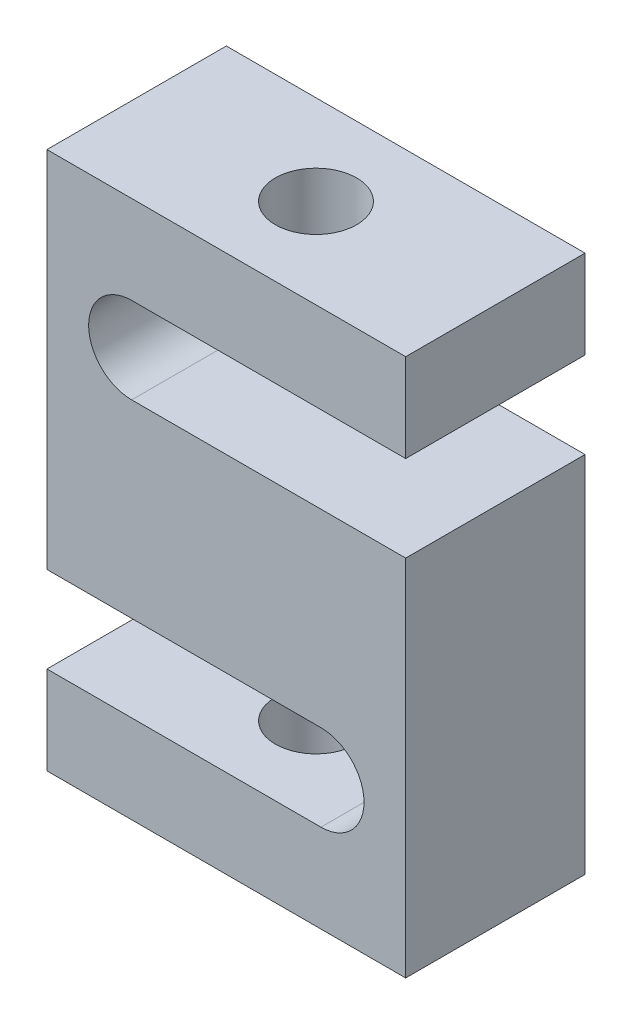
ISO-10303-21;
HEADER;
FILE_DESCRIPTION(('STEP AP214'),'2;1');
FILE_NAME('part.step','',(''),(''),'','','');
FILE_SCHEMA(('AUTOMOTIVE_DESIGN { 1 0 10303 214 1 1 1 1 }'));
ENDSEC;
DATA;
#1=APPLICATION_CONTEXT('core data for automotive mechanical design processes');
#2=APPLICATION_PROTOCOL_DEFINITION('international standard','automotive_design',2000,#1);
#3=PRODUCT_CONTEXT('',#1,'mechanical');
#4=PRODUCT('Part','Part','',(#3));
#5=PRODUCT_RELATED_PRODUCT_CATEGORY('part','',(#4));
#6=PRODUCT_DEFINITION_FORMATION('','',#4);
#7=PRODUCT_DEFINITION_CONTEXT('part definition',#1,'design');
#8=PRODUCT_DEFINITION('design','',#6,#7);
#9=PRODUCT_DEFINITION_SHAPE('','',#8);
#10=(LENGTH_UNIT() NAMED_UNIT(*) SI_UNIT(.MILLI.,.METRE.));
#11=(NAMED_UNIT(*) PLANE_ANGLE_UNIT() SI_UNIT($,.RADIAN.));
#12=(NAMED_UNIT(*) SI_UNIT($,.STERADIAN.) SOLID_ANGLE_UNIT());
#13=UNCERTAINTY_MEASURE_WITH_UNIT(LENGTH_MEASURE(1.E-05),#10,'distance_accuracy_value','');
#14=(GEOMETRIC_REPRESENTATION_CONTEXT(3) GLOBAL_UNCERTAINTY_ASSIGNED_CONTEXT((#13)) GLOBAL_UNIT_ASSIGNED_CONTEXT((#10,
#11,#12)) REPRESENTATION_CONTEXT('',''));
#15=CARTESIAN_POINT('',(0.,0.,0.));
#16=DIRECTION('',(0.,0.,1.));
#17=DIRECTION('',(1.,0.,0.));
#18=AXIS2_PLACEMENT_3D('',#15,#16,#17);
#19=CARTESIAN_POINT('',(25.4,13.4,12.7));
#20=DIRECTION('',(-1.,0.,0.));
#21=DIRECTION('',(0.,-1.,0.));
#22=AXIS2_PLACEMENT_3D('',#19,#20,#21);
#23=PLANE('',#22);
#24=DIRECTION('',(0.,1.,0.));
#25=VECTOR('',#24,1.);
#26=CARTESIAN_POINT('',(25.4,13.4,-12.7));
#27=LINE('',#26,#25);
#28=CARTESIAN_POINT('',(25.4,-38.1,-12.7));
#29=VERTEX_POINT('',#28);
#30=CARTESIAN_POINT('',(25.4,13.4,-12.7));
#31=VERTEX_POINT('',#30);
#32=EDGE_CURVE('E155',#29,#31,#27,.T.);
#33=ORIENTED_EDGE('',*,*,#32,.T.);
#34=DIRECTION('',(0.,0.,-1.));
#35=VECTOR('',#34,1.);
#36=CARTESIAN_POINT('',(25.4,13.4,12.7));
#37=LINE('',#36,#35);
#38=CARTESIAN_POINT('',(25.4,13.4,12.7));
#39=VERTEX_POINT('',#38);
#40=EDGE_CURVE('E11',#39,#31,#37,.T.);
#41=ORIENTED_EDGE('',*,*,#40,.F.);
#42=DIRECTION('',(0.,1.,0.));
#43=VECTOR('',#42,1.);
#44=CARTESIAN_POINT('',(25.4,13.4,12.7));
#45=LINE('',#44,#43);
#46=CARTESIAN_POINT('',(25.4,-38.1,12.7));
#47=VERTEX_POINT('',#46);
#48=EDGE_CURVE('E178',#47,#39,#45,.T.);
#49=ORIENTED_EDGE('',*,*,#48,.F.);
#50=DIRECTION('',(0.,0.,-1.));
#51=VECTOR('',#50,1.);
#52=CARTESIAN_POINT('',(25.4,-38.1,12.7));
#53=LINE('',#52,#51);
#54=EDGE_CURVE('E151',#47,#29,#53,.T.);
#55=ORIENTED_EDGE('',*,*,#54,.T.);
#56=EDGE_LOOP('',(#33,#41,#49,#55));
#57=FACE_BOUND('',#56,.T.);
#58=ADVANCED_FACE('F35',(#57),#23,.F.);
#59=CARTESIAN_POINT('',(25.4,13.4,12.7));
#60=DIRECTION('',(0.,-1.,0.));
#61=DIRECTION('',(1.,0.,0.));
#62=AXIS2_PLACEMENT_3D('',#59,#60,#61);
#63=PLANE('',#62);
#64=DIRECTION('',(-1.,0.,0.));
#65=VECTOR('',#64,1.);
#66=CARTESIAN_POINT('',(25.4,13.4,-12.7));
#67=LINE('',#66,#65);
#68=CARTESIAN_POINT('',(-13.4,13.4,-12.7));
#69=VERTEX_POINT('',#68);
#70=EDGE_CURVE('E158',#31,#69,#67,.T.);
#71=ORIENTED_EDGE('',*,*,#70,.T.);
#72=DIRECTION('',(0.,0.,-1.));
#73=VECTOR('',#72,1.);
#74=CARTESIAN_POINT('',(-13.4,13.4,12.7));
#75=LINE('',#74,#73);
#76=CARTESIAN_POINT('',(-13.4,13.4,12.7));
#77=VERTEX_POINT('',#76);
#78=EDGE_CURVE('E43',#77,#69,#75,.T.);
#79=ORIENTED_EDGE('',*,*,#78,.F.);
#80=DIRECTION('',(-1.,0.,0.));
#81=VECTOR('',#80,1.);
#82=CARTESIAN_POINT('',(25.4,13.4,12.7));
#83=LINE('',#82,#81);
#84=EDGE_CURVE('E106',#39,#77,#83,.T.);
#85=ORIENTED_EDGE('',*,*,#84,.F.);
#86=ORIENTED_EDGE('',*,*,#40,.T.);
#87=EDGE_LOOP('',(#71,#79,#85,#86));
#88=FACE_BOUND('',#87,.T.);
#89=ADVANCED_FACE('F258',(#88),#63,.F.);
#90=CARTESIAN_POINT('',(-13.4,19.5,12.7));
#91=DIRECTION('',(0.,0.,-1.));
#92=DIRECTION('',(-1.,0.,0.));
#93=AXIS2_PLACEMENT_3D('',#90,#91,#92);
#94=CYLINDRICAL_SURFACE('',#93,6.09999999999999);
#95=CARTESIAN_POINT('',(-13.4,19.5,-12.7));
#96=DIRECTION('',(0.,0.,-1.));
#97=DIRECTION('',(1.,0.,0.));
#98=AXIS2_PLACEMENT_3D('',#95,#96,#97);
#99=CIRCLE('',#98,6.09999999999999);
#100=CARTESIAN_POINT('',(-13.4,25.6,-12.7));
#101=VERTEX_POINT('',#100);
#102=EDGE_CURVE('E161',#69,#101,#99,.T.);
#103=ORIENTED_EDGE('',*,*,#102,.T.);
#104=DIRECTION('',(0.,0.,-1.));
#105=VECTOR('',#104,1.);
#106=CARTESIAN_POINT('',(-13.4,25.6,12.7));
#107=LINE('',#106,#105);
#108=CARTESIAN_POINT('',(-13.4,25.6,12.7));
#109=VERTEX_POINT('',#108);
#110=EDGE_CURVE('E197',#109,#101,#107,.T.);
#111=ORIENTED_EDGE('',*,*,#110,.F.);
#112=CARTESIAN_POINT('',(-13.4,19.5,12.7));
#113=DIRECTION('',(0.,0.,-1.));
#114=DIRECTION('',(1.,0.,0.));
#115=AXIS2_PLACEMENT_3D('',#112,#113,#114);
#116=CIRCLE('',#115,6.09999999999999);
#117=EDGE_CURVE('E205',#77,#109,#116,.T.);
#118=ORIENTED_EDGE('',*,*,#117,.F.);
#119=ORIENTED_EDGE('',*,*,#78,.T.);
#120=EDGE_LOOP('',(#103,#111,#118,#119));
#121=FACE_BOUND('',#120,.T.);
#122=ADVANCED_FACE('F203',(#121),#94,.F.);
#123=CARTESIAN_POINT('',(25.4,25.6,12.7));
#124=DIRECTION('',(0.,1.,0.));
#125=DIRECTION('',(-1.,0.,0.));
#126=AXIS2_PLACEMENT_3D('',#123,#124,#125);
#127=PLANE('',#126);
#128=CARTESIAN_POINT('',(0.,25.6,0.));
#129=DIRECTION('',(0.,1.,0.));
#130=DIRECTION('',(-1.,0.,0.));
#131=AXIS2_PLACEMENT_3D('',#128,#129,#130);
#132=CIRCLE('',#131,5.75436999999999);
#133=CARTESIAN_POINT('',(-5.75436999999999,25.6,0.));
#134=VERTEX_POINT('',#133);
#135=EDGE_CURVE('E159',#134,#134,#132,.T.);
#136=ORIENTED_EDGE('',*,*,#135,.T.);
#137=EDGE_LOOP('',(#136));
#138=FACE_BOUND('',#137,.T.);
#139=DIRECTION('',(1.,0.,0.));
#140=VECTOR('',#139,1.);
#141=CARTESIAN_POINT('',(25.4,25.6,-12.7));
#142=LINE('',#141,#140);
#143=CARTESIAN_POINT('',(25.4,25.6,-12.7));
#144=VERTEX_POINT('',#143);
#145=EDGE_CURVE('E163',#101,#144,#142,.T.);
#146=ORIENTED_EDGE('',*,*,#145,.T.);
#147=DIRECTION('',(0.,0.,-1.));
#148=VECTOR('',#147,1.);
#149=CARTESIAN_POINT('',(25.4,25.6,12.7));
#150=LINE('',#149,#148);
#151=CARTESIAN_POINT('',(25.4,25.6,12.7));
#152=VERTEX_POINT('',#151);
#153=EDGE_CURVE('E194',#152,#144,#150,.T.);
#154=ORIENTED_EDGE('',*,*,#153,.F.);
#155=DIRECTION('',(1.,0.,0.));
#156=VECTOR('',#155,1.);
#157=CARTESIAN_POINT('',(25.4,25.6,12.7));
#158=LINE('',#157,#156);
#159=EDGE_CURVE('E223',#109,#152,#158,.T.);
#160=ORIENTED_EDGE('',*,*,#159,.F.);
#161=ORIENTED_EDGE('',*,*,#110,.T.);
#162=EDGE_LOOP('',(#146,#154,#160,#161));
#163=FACE_BOUND('',#162,.T.);
#164=ADVANCED_FACE('F214',(#138,#163),#127,.F.);
#165=CARTESIAN_POINT('',(25.4,38.1,12.7));
#166=DIRECTION('',(-1.,0.,0.));
#167=DIRECTION('',(0.,-1.,0.));
#168=AXIS2_PLACEMENT_3D('',#165,#166,#167);
#169=PLANE('',#168);
#170=DIRECTION('',(0.,1.,0.));
#171=VECTOR('',#170,1.);
#172=CARTESIAN_POINT('',(25.4,38.1,-12.7));
#173=LINE('',#172,#171);
#174=CARTESIAN_POINT('',(25.4,38.1,-12.7));
#175=VERTEX_POINT('',#174);
#176=EDGE_CURVE('E165',#144,#175,#173,.T.);
#177=ORIENTED_EDGE('',*,*,#176,.T.);
#178=DIRECTION('',(0.,0.,-1.));
#179=VECTOR('',#178,1.);
#180=CARTESIAN_POINT('',(25.4,38.1,12.7));
#181=LINE('',#180,#179);
#182=CARTESIAN_POINT('',(25.4,38.1,12.7));
#183=VERTEX_POINT('',#182);
#184=EDGE_CURVE('E191',#183,#175,#181,.T.);
#185=ORIENTED_EDGE('',*,*,#184,.F.);
#186=DIRECTION('',(0.,1.,0.));
#187=VECTOR('',#186,1.);
#188=CARTESIAN_POINT('',(25.4,38.1,12.7));
#189=LINE('',#188,#187);
#190=EDGE_CURVE('E220',#152,#183,#189,.T.);
#191=ORIENTED_EDGE('',*,*,#190,.F.);
#192=ORIENTED_EDGE('',*,*,#153,.T.);
#193=EDGE_LOOP('',(#177,#185,#191,#192));
#194=FACE_BOUND('',#193,.T.);
#195=ADVANCED_FACE('F218',(#194),#169,.F.);
#196=CARTESIAN_POINT('',(-25.4,38.1,12.7));
#197=DIRECTION('',(0.,-1.,0.));
#198=DIRECTION('',(0.,0.,-1.));
#199=AXIS2_PLACEMENT_3D('',#196,#197,#198);
#200=PLANE('',#199);
#201=CARTESIAN_POINT('',(0.,38.1,0.));
#202=DIRECTION('',(0.,1.,0.));
#203=DIRECTION('',(0.,0.,1.));
#204=AXIS2_PLACEMENT_3D('',#201,#202,#203);
#205=CIRCLE('',#204,5.75436999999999);
#206=CARTESIAN_POINT('',(0.,38.1,5.75436999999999));
#207=VERTEX_POINT('',#206);
#208=EDGE_CURVE('E292',#207,#207,#205,.T.);
#209=ORIENTED_EDGE('',*,*,#208,.F.);
#210=EDGE_LOOP('',(#209));
#211=FACE_BOUND('',#210,.T.);
#212=DIRECTION('',(-1.,0.,0.));
#213=VECTOR('',#212,1.);
#214=CARTESIAN_POINT('',(-25.4,38.1,-12.7));
#215=LINE('',#214,#213);
#216=CARTESIAN_POINT('',(-25.4,38.1,-12.7));
#217=VERTEX_POINT('',#216);
#218=EDGE_CURVE('E167',#175,#217,#215,.T.);
#219=ORIENTED_EDGE('',*,*,#218,.T.);
#220=DIRECTION('',(0.,0.,-1.));
#221=VECTOR('',#220,1.);
#222=CARTESIAN_POINT('',(-25.4,38.1,12.7));
#223=LINE('',#222,#221);
#224=CARTESIAN_POINT('',(-25.4,38.1,12.7));
#225=VERTEX_POINT('',#224);
#226=EDGE_CURVE('E188',#225,#217,#223,.T.);
#227=ORIENTED_EDGE('',*,*,#226,.F.);
#228=DIRECTION('',(-1.,0.,0.));
#229=VECTOR('',#228,1.);
#230=CARTESIAN_POINT('',(-25.4,38.1,12.7));
#231=LINE('',#230,#229);
#232=EDGE_CURVE('E222',#183,#225,#231,.T.);
#233=ORIENTED_EDGE('',*,*,#232,.F.);
#234=ORIENTED_EDGE('',*,*,#184,.T.);
#235=EDGE_LOOP('',(#219,#227,#233,#234));
#236=FACE_BOUND('',#235,.T.);
#237=ADVANCED_FACE('F272',(#211,#236),#200,.F.);
#238=CARTESIAN_POINT('',(-25.4,38.1,12.7));
#239=DIRECTION('',(1.,0.,0.));
#240=DIRECTION('',(0.,1.,0.));
#241=AXIS2_PLACEMENT_3D('',#238,#239,#240);
#242=PLANE('',#241);
#243=DIRECTION('',(0.,-1.,0.));
#244=VECTOR('',#243,1.);
#245=CARTESIAN_POINT('',(-25.4,38.1,-12.7));
#246=LINE('',#245,#244);
#247=CARTESIAN_POINT('',(-25.4,-13.4,-12.7));
#248=VERTEX_POINT('',#247);
#249=EDGE_CURVE('E169',#217,#248,#246,.T.);
#250=ORIENTED_EDGE('',*,*,#249,.T.);
#251=DIRECTION('',(0.,0.,-1.));
#252=VECTOR('',#251,1.);
#253=CARTESIAN_POINT('',(-25.4,-13.4,12.7));
#254=LINE('',#253,#252);
#255=CARTESIAN_POINT('',(-25.4,-13.4,12.7));
#256=VERTEX_POINT('',#255);
#257=EDGE_CURVE('E185',#256,#248,#254,.T.);
#258=ORIENTED_EDGE('',*,*,#257,.F.);
#259=DIRECTION('',(0.,-1.,0.));
#260=VECTOR('',#259,1.);
#261=CARTESIAN_POINT('',(-25.4,38.1,12.7));
#262=LINE('',#261,#260);
#263=EDGE_CURVE('E225',#225,#256,#262,.T.);
#264=ORIENTED_EDGE('',*,*,#263,.F.);
#265=ORIENTED_EDGE('',*,*,#226,.T.);
#266=EDGE_LOOP('',(#250,#258,#264,#265));
#267=FACE_BOUND('',#266,.T.);
#268=ADVANCED_FACE('F275',(#267),#242,.F.);
#269=CARTESIAN_POINT('',(-25.4,-13.4,12.7));
#270=DIRECTION('',(0.,1.,0.));
#271=DIRECTION('',(0.,0.,1.));
#272=AXIS2_PLACEMENT_3D('',#269,#270,#271);
#273=PLANE('',#272);
#274=DIRECTION('',(1.,0.,0.));
#275=VECTOR('',#274,1.);
#276=CARTESIAN_POINT('',(-25.4,-13.4,-12.7));
#277=LINE('',#276,#275);
#278=CARTESIAN_POINT('',(13.4,-13.4,-12.7));
#279=VERTEX_POINT('',#278);
#280=EDGE_CURVE('E171',#248,#279,#277,.T.);
#281=ORIENTED_EDGE('',*,*,#280,.T.);
#282=DIRECTION('',(0.,0.,-1.));
#283=VECTOR('',#282,1.);
#284=CARTESIAN_POINT('',(13.4,-13.4,12.7));
#285=LINE('',#284,#283);
#286=CARTESIAN_POINT('',(13.4,-13.4,12.7));
#287=VERTEX_POINT('',#286);
#288=EDGE_CURVE('E182',#287,#279,#285,.T.);
#289=ORIENTED_EDGE('',*,*,#288,.F.);
#290=DIRECTION('',(1.,0.,0.));
#291=VECTOR('',#290,1.);
#292=CARTESIAN_POINT('',(-25.4,-13.4,12.7));
#293=LINE('',#292,#291);
#294=EDGE_CURVE('E231',#256,#287,#293,.T.);
#295=ORIENTED_EDGE('',*,*,#294,.F.);
#296=ORIENTED_EDGE('',*,*,#257,.T.);
#297=EDGE_LOOP('',(#281,#289,#295,#296));
#298=FACE_BOUND('',#297,.T.);
#299=ADVANCED_FACE('F237',(#298),#273,.F.);
#300=CARTESIAN_POINT('',(13.4,-19.5,12.7));
#301=DIRECTION('',(0.,0.,-1.));
#302=DIRECTION('',(-1.,0.,0.));
#303=AXIS2_PLACEMENT_3D('',#300,#301,#302);
#304=CYLINDRICAL_SURFACE('',#303,6.09999999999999);
#305=CARTESIAN_POINT('',(13.4,-19.5,-12.7));
#306=DIRECTION('',(0.,0.,-1.));
#307=DIRECTION('',(1.,0.,0.));
#308=AXIS2_PLACEMENT_3D('',#305,#306,#307);
#309=CIRCLE('',#308,6.09999999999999);
#310=CARTESIAN_POINT('',(13.4,-25.6,-12.7));
#311=VERTEX_POINT('',#310);
#312=EDGE_CURVE('E173',#279,#311,#309,.T.);
#313=ORIENTED_EDGE('',*,*,#312,.T.);
#314=DIRECTION('',(0.,0.,-1.));
#315=VECTOR('',#314,1.);
#316=CARTESIAN_POINT('',(13.4,-25.6,12.7));
#317=LINE('',#316,#315);
#318=CARTESIAN_POINT('',(13.4,-25.6,12.7));
#319=VERTEX_POINT('',#318);
#320=EDGE_CURVE('E146',#319,#311,#317,.T.);
#321=ORIENTED_EDGE('',*,*,#320,.F.);
#322=CARTESIAN_POINT('',(13.4,-19.5,12.7));
#323=DIRECTION('',(0.,0.,-1.));
#324=DIRECTION('',(1.,0.,0.));
#325=AXIS2_PLACEMENT_3D('',#322,#323,#324);
#326=CIRCLE('',#325,6.09999999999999);
#327=EDGE_CURVE('E137',#287,#319,#326,.T.);
#328=ORIENTED_EDGE('',*,*,#327,.F.);
#329=ORIENTED_EDGE('',*,*,#288,.T.);
#330=EDGE_LOOP('',(#313,#321,#328,#329));
#331=FACE_BOUND('',#330,.T.);
#332=ADVANCED_FACE('F241',(#331),#304,.F.);
#333=CARTESIAN_POINT('',(13.4,-25.6,12.7));
#334=DIRECTION('',(0.,-1.,0.));
#335=DIRECTION('',(1.,0.,0.));
#336=AXIS2_PLACEMENT_3D('',#333,#334,#335);
#337=PLANE('',#336);
#338=CARTESIAN_POINT('',(0.,-25.6,0.));
#339=DIRECTION('',(0.,-1.,0.));
#340=DIRECTION('',(1.,0.,0.));
#341=AXIS2_PLACEMENT_3D('',#338,#339,#340);
#342=CIRCLE('',#341,5.75436999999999);
#343=CARTESIAN_POINT('',(5.75436999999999,-25.6,0.));
#344=VERTEX_POINT('',#343);
#345=EDGE_CURVE('E290',#344,#344,#342,.T.);
#346=ORIENTED_EDGE('',*,*,#345,.T.);
#347=EDGE_LOOP('',(#346));
#348=FACE_BOUND('',#347,.T.);
#349=DIRECTION('',(-1.,0.,0.));
#350=VECTOR('',#349,1.);
#351=CARTESIAN_POINT('',(13.4,-25.6,-12.7));
#352=LINE('',#351,#350);
#353=CARTESIAN_POINT('',(-25.4,-25.6,-12.7));
#354=VERTEX_POINT('',#353);
#355=EDGE_CURVE('E145',#311,#354,#352,.T.);
#356=ORIENTED_EDGE('',*,*,#355,.T.);
#357=DIRECTION('',(0.,0.,-1.));
#358=VECTOR('',#357,1.);
#359=CARTESIAN_POINT('',(-25.4,-25.6,12.7));
#360=LINE('',#359,#358);
#361=CARTESIAN_POINT('',(-25.4,-25.6,12.7));
#362=VERTEX_POINT('',#361);
#363=EDGE_CURVE('E142',#362,#354,#360,.T.);
#364=ORIENTED_EDGE('',*,*,#363,.F.);
#365=DIRECTION('',(-1.,0.,0.));
#366=VECTOR('',#365,1.);
#367=CARTESIAN_POINT('',(13.4,-25.6,12.7));
#368=LINE('',#367,#366);
#369=EDGE_CURVE('E131',#319,#362,#368,.T.);
#370=ORIENTED_EDGE('',*,*,#369,.F.);
#371=ORIENTED_EDGE('',*,*,#320,.T.);
#372=EDGE_LOOP('',(#356,#364,#370,#371));
#373=FACE_BOUND('',#372,.T.);
#374=ADVANCED_FACE('F143',(#348,#373),#337,.F.);
#375=CARTESIAN_POINT('',(-25.4,-25.6,12.7));
#376=DIRECTION('',(1.,0.,0.));
#377=DIRECTION('',(0.,1.,0.));
#378=AXIS2_PLACEMENT_3D('',#375,#376,#377);
#379=PLANE('',#378);
#380=DIRECTION('',(0.,-1.,0.));
#381=VECTOR('',#380,1.);
#382=CARTESIAN_POINT('',(-25.4,-25.6,-12.7));
#383=LINE('',#382,#381);
#384=CARTESIAN_POINT('',(-25.4,-38.1,-12.7));
#385=VERTEX_POINT('',#384);
#386=EDGE_CURVE('E92',#354,#385,#383,.T.);
#387=ORIENTED_EDGE('',*,*,#386,.T.);
#388=DIRECTION('',(0.,0.,-1.));
#389=VECTOR('',#388,1.);
#390=CARTESIAN_POINT('',(-25.4,-38.1,12.7));
#391=LINE('',#390,#389);
#392=CARTESIAN_POINT('',(-25.4,-38.1,12.7));
#393=VERTEX_POINT('',#392);
#394=EDGE_CURVE('E147',#393,#385,#391,.T.);
#395=ORIENTED_EDGE('',*,*,#394,.F.);
#396=DIRECTION('',(0.,-1.,0.));
#397=VECTOR('',#396,1.);
#398=CARTESIAN_POINT('',(-25.4,-25.6,12.7));
#399=LINE('',#398,#397);
#400=EDGE_CURVE('E135',#362,#393,#399,.T.);
#401=ORIENTED_EDGE('',*,*,#400,.F.);
#402=ORIENTED_EDGE('',*,*,#363,.T.);
#403=EDGE_LOOP('',(#387,#395,#401,#402));
#404=FACE_BOUND('',#403,.T.);
#405=ADVANCED_FACE('F149',(#404),#379,.F.);
#406=CARTESIAN_POINT('',(-25.4,-38.1,12.7));
#407=DIRECTION('',(0.,1.,0.));
#408=DIRECTION('',(-1.,0.,0.));
#409=AXIS2_PLACEMENT_3D('',#406,#407,#408);
#410=PLANE('',#409);
#411=CARTESIAN_POINT('',(0.,-38.1,0.));
#412=DIRECTION('',(0.,-1.,0.));
#413=DIRECTION('',(0.,0.,-1.));
#414=AXIS2_PLACEMENT_3D('',#411,#412,#413);
#415=CIRCLE('',#414,5.75436999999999);
#416=CARTESIAN_POINT('',(0.,-38.1,-5.75436999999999));
#417=VERTEX_POINT('',#416);
#418=EDGE_CURVE('E293',#417,#417,#415,.T.);
#419=ORIENTED_EDGE('',*,*,#418,.F.);
#420=EDGE_LOOP('',(#419));
#421=FACE_BOUND('',#420,.T.);
#422=DIRECTION('',(1.,0.,0.));
#423=VECTOR('',#422,1.);
#424=CARTESIAN_POINT('',(-25.4,-38.1,-12.7));
#425=LINE('',#424,#423);
#426=EDGE_CURVE('E98',#385,#29,#425,.T.);
#427=ORIENTED_EDGE('',*,*,#426,.T.);
#428=ORIENTED_EDGE('',*,*,#54,.F.);
#429=DIRECTION('',(1.,0.,0.));
#430=VECTOR('',#429,1.);
#431=CARTESIAN_POINT('',(-25.4,-38.1,12.7));
#432=LINE('',#431,#430);
#433=EDGE_CURVE('E51',#393,#47,#432,.T.);
#434=ORIENTED_EDGE('',*,*,#433,.F.);
#435=ORIENTED_EDGE('',*,*,#394,.T.);
#436=EDGE_LOOP('',(#427,#428,#434,#435));
#437=FACE_BOUND('',#436,.T.);
#438=ADVANCED_FACE('F245',(#421,#437),#410,.F.);
#439=CARTESIAN_POINT('',(13.4,-19.5,12.7));
#440=DIRECTION('',(0.,0.,1.));
#441=DIRECTION('',(1.,0.,0.));
#442=AXIS2_PLACEMENT_3D('',#439,#440,#441);
#443=PLANE('',#442);
#444=ORIENTED_EDGE('',*,*,#48,.T.);
#445=ORIENTED_EDGE('',*,*,#84,.T.);
#446=ORIENTED_EDGE('',*,*,#117,.T.);
#447=ORIENTED_EDGE('',*,*,#159,.T.);
#448=ORIENTED_EDGE('',*,*,#190,.T.);
#449=ORIENTED_EDGE('',*,*,#232,.T.);
#450=ORIENTED_EDGE('',*,*,#263,.T.);
#451=ORIENTED_EDGE('',*,*,#294,.T.);
#452=ORIENTED_EDGE('',*,*,#327,.T.);
#453=ORIENTED_EDGE('',*,*,#369,.T.);
#454=ORIENTED_EDGE('',*,*,#400,.T.);
#455=ORIENTED_EDGE('',*,*,#433,.T.);
#456=EDGE_LOOP('',(#444,#445,#446,#447,#448,#449,#450,#451,#452,#453,#454,#455));
#457=FACE_BOUND('',#456,.T.);
#458=ADVANCED_FACE('F133',(#457),#443,.T.);
#459=CARTESIAN_POINT('',(13.4,-19.5,-12.7));
#460=DIRECTION('',(0.,0.,1.));
#461=DIRECTION('',(1.,0.,0.));
#462=AXIS2_PLACEMENT_3D('',#459,#460,#461);
#463=PLANE('',#462);
#464=ORIENTED_EDGE('',*,*,#32,.F.);
#465=ORIENTED_EDGE('',*,*,#426,.F.);
#466=ORIENTED_EDGE('',*,*,#386,.F.);
#467=ORIENTED_EDGE('',*,*,#355,.F.);
#468=ORIENTED_EDGE('',*,*,#312,.F.);
#469=ORIENTED_EDGE('',*,*,#280,.F.);
#470=ORIENTED_EDGE('',*,*,#249,.F.);
#471=ORIENTED_EDGE('',*,*,#218,.F.);
#472=ORIENTED_EDGE('',*,*,#176,.F.);
#473=ORIENTED_EDGE('',*,*,#145,.F.);
#474=ORIENTED_EDGE('',*,*,#102,.F.);
#475=ORIENTED_EDGE('',*,*,#70,.F.);
#476=EDGE_LOOP('',(#464,#465,#466,#467,#468,#469,#470,#471,#472,#473,#474,#475));
#477=FACE_BOUND('',#476,.T.);
#478=ADVANCED_FACE('F209',(#477),#463,.F.);
#479=CARTESIAN_POINT('',(0.,38.1,0.));
#480=DIRECTION('',(0.,1.,0.));
#481=DIRECTION('',(0.,0.,1.));
#482=AXIS2_PLACEMENT_3D('',#479,#480,#481);
#483=CYLINDRICAL_SURFACE('',#482,5.75436999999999);
#484=ORIENTED_EDGE('',*,*,#135,.F.);
#485=EDGE_LOOP('',(#484));
#486=FACE_BOUND('',#485,.T.);
#487=ORIENTED_EDGE('',*,*,#208,.T.);
#488=EDGE_LOOP('',(#487));
#489=FACE_BOUND('',#488,.T.);
#490=ADVANCED_FACE('F305',(#486,#489),#483,.F.);
#491=CARTESIAN_POINT('',(0.,-38.1,0.));
#492=DIRECTION('',(0.,-1.,0.));
#493=DIRECTION('',(0.,0.,-1.));
#494=AXIS2_PLACEMENT_3D('',#491,#492,#493);
#495=CYLINDRICAL_SURFACE('',#494,5.75436999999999);
#496=ORIENTED_EDGE('',*,*,#345,.F.);
#497=EDGE_LOOP('',(#496));
#498=FACE_BOUND('',#497,.T.);
#499=ORIENTED_EDGE('',*,*,#418,.T.);
#500=EDGE_LOOP('',(#499));
#501=FACE_BOUND('',#500,.T.);
#502=ADVANCED_FACE('F308',(#498,#501),#495,.F.);
#503=CLOSED_SHELL('',(#58,#89,#122,#164,#195,#237,#268,#299,#332,#374,#405,#438,#458,#478,#490,#502));
#504=MANIFOLD_SOLID_BREP('B2',#503);
#505=ADVANCED_BREP_SHAPE_REPRESENTATION('',(#18,#504),#14);
#506=SHAPE_DEFINITION_REPRESENTATION(#9,#505);
ENDSEC;
END-ISO-10303-21;
